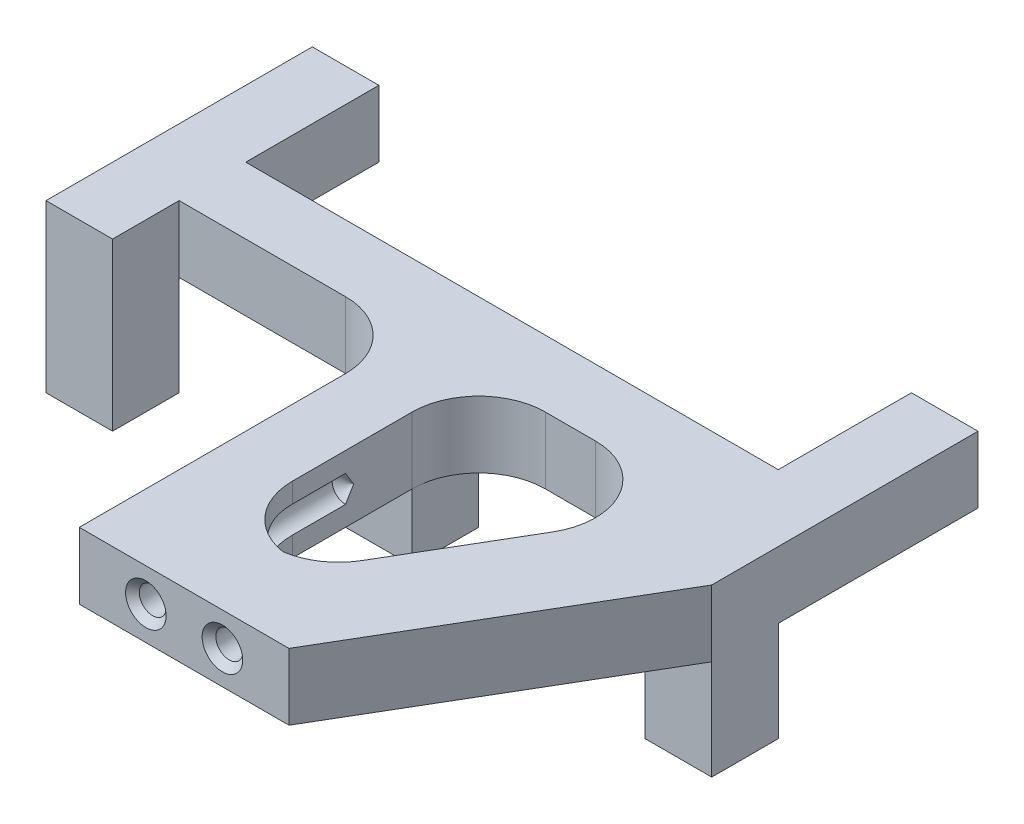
ISO-10303-21;
HEADER;
FILE_DESCRIPTION(('STEP AP214'),'2;1');
FILE_NAME('part.step','',(''),(''),'','','');
FILE_SCHEMA(('AUTOMOTIVE_DESIGN { 1 0 10303 214 1 1 1 1 }'));
ENDSEC;
DATA;
#1=APPLICATION_CONTEXT('core data for automotive mechanical design processes');
#2=APPLICATION_PROTOCOL_DEFINITION('international standard','automotive_design',2000,#1);
#3=PRODUCT_CONTEXT('',#1,'mechanical');
#4=PRODUCT('Part','Part','',(#3));
#5=PRODUCT_RELATED_PRODUCT_CATEGORY('part','',(#4));
#6=PRODUCT_DEFINITION_FORMATION('','',#4);
#7=PRODUCT_DEFINITION_CONTEXT('part definition',#1,'design');
#8=PRODUCT_DEFINITION('design','',#6,#7);
#9=PRODUCT_DEFINITION_SHAPE('','',#8);
#10=(LENGTH_UNIT() NAMED_UNIT(*) SI_UNIT(.MILLI.,.METRE.));
#11=(NAMED_UNIT(*) PLANE_ANGLE_UNIT() SI_UNIT($,.RADIAN.));
#12=(NAMED_UNIT(*) SI_UNIT($,.STERADIAN.) SOLID_ANGLE_UNIT());
#13=UNCERTAINTY_MEASURE_WITH_UNIT(LENGTH_MEASURE(1.E-05),#10,'distance_accuracy_value','');
#14=(GEOMETRIC_REPRESENTATION_CONTEXT(3) GLOBAL_UNCERTAINTY_ASSIGNED_CONTEXT((#13)) GLOBAL_UNIT_ASSIGNED_CONTEXT((#10,
#11,#12)) REPRESENTATION_CONTEXT('',''));
#15=CARTESIAN_POINT('',(0.,0.,0.));
#16=DIRECTION('',(0.,0.,1.));
#17=DIRECTION('',(1.,0.,0.));
#18=AXIS2_PLACEMENT_3D('',#15,#16,#17);
#19=CARTESIAN_POINT('',(0.,0.,50.));
#20=DIRECTION('',(-1.,0.,0.));
#21=DIRECTION('',(0.,0.,1.));
#22=AXIS2_PLACEMENT_3D('',#19,#20,#21);
#23=PLANE('',#22);
#24=DIRECTION('',(0.,0.,-1.));
#25=VECTOR('',#24,1.);
#26=CARTESIAN_POINT('',(0.,10.,50.));
#27=LINE('',#26,#25);
#28=CARTESIAN_POINT('',(0.,10.,50.));
#29=VERTEX_POINT('',#28);
#30=CARTESIAN_POINT('',(0.,10.,10.));
#31=VERTEX_POINT('',#30);
#32=EDGE_CURVE('E411',#29,#31,#27,.T.);
#33=ORIENTED_EDGE('',*,*,#32,.T.);
#34=DIRECTION('',(0.,1.,0.));
#35=VECTOR('',#34,1.);
#36=CARTESIAN_POINT('',(0.,0.,10.));
#37=LINE('',#36,#35);
#38=CARTESIAN_POINT('',(0.,0.,10.));
#39=VERTEX_POINT('',#38);
#40=EDGE_CURVE('E413',#31,#39,#37,.F.);
#41=ORIENTED_EDGE('',*,*,#40,.T.);
#42=DIRECTION('',(0.,0.,-1.));
#43=VECTOR('',#42,1.);
#44=CARTESIAN_POINT('',(0.,0.,50.));
#45=LINE('',#44,#43);
#46=CARTESIAN_POINT('',(0.,0.,50.));
#47=VERTEX_POINT('',#46);
#48=EDGE_CURVE('E420',#47,#39,#45,.T.);
#49=ORIENTED_EDGE('',*,*,#48,.F.);
#50=DIRECTION('',(0.,1.,0.));
#51=VECTOR('',#50,1.);
#52=CARTESIAN_POINT('',(0.,0.,50.));
#53=LINE('',#52,#51);
#54=EDGE_CURVE('E416',#47,#29,#53,.T.);
#55=ORIENTED_EDGE('',*,*,#54,.T.);
#56=EDGE_LOOP('',(#33,#41,#49,#55));
#57=FACE_BOUND('',#56,.T.);
#58=ADVANCED_FACE('F35',(#57),#23,.T.);
#59=CARTESIAN_POINT('',(10.,0.,50.));
#60=DIRECTION('',(-1.,0.,0.));
#61=DIRECTION('',(0.,0.,1.));
#62=AXIS2_PLACEMENT_3D('',#59,#60,#61);
#63=PLANE('',#62);
#64=DIRECTION('',(0.,-0.857167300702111,0.515038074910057));
#65=VECTOR('',#64,1.);
#66=CARTESIAN_POINT('',(10.,4.99999999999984,18.7866821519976));
#67=LINE('',#66,#65);
#68=CARTESIAN_POINT('',(10.0000000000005,4.99999999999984,18.7866821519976));
#69=VERTEX_POINT('',#68);
#70=CARTESIAN_POINT('',(10.,2.98069999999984,20.));
#71=VERTEX_POINT('',#70);
#72=EDGE_CURVE('E11',#69,#71,#67,.T.);
#73=ORIENTED_EDGE('',*,*,#72,.T.);
#74=DIRECTION('',(0.,0.,1.));
#75=VECTOR('',#74,1.);
#76=CARTESIAN_POINT('',(10.,2.98069999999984,50.));
#77=LINE('',#76,#75);
#78=CARTESIAN_POINT('',(10.,2.98069999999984,28.));
#79=VERTEX_POINT('',#78);
#80=EDGE_CURVE('E466',#71,#79,#77,.T.);
#81=ORIENTED_EDGE('',*,*,#80,.T.);
#82=DIRECTION('',(0.,-1.,0.));
#83=VECTOR('',#82,1.);
#84=CARTESIAN_POINT('',(10.,0.,28.));
#85=LINE('',#84,#83);
#86=CARTESIAN_POINT('',(10.,0.,28.));
#87=VERTEX_POINT('',#86);
#88=EDGE_CURVE('E653',#79,#87,#85,.T.);
#89=ORIENTED_EDGE('',*,*,#88,.T.);
#90=DIRECTION('',(0.,0.,-1.));
#91=VECTOR('',#90,1.);
#92=CARTESIAN_POINT('',(10.,0.,50.));
#93=LINE('',#92,#91);
#94=CARTESIAN_POINT('',(10.,0.,10.));
#95=VERTEX_POINT('',#94);
#96=EDGE_CURVE('E636',#87,#95,#93,.T.);
#97=ORIENTED_EDGE('',*,*,#96,.T.);
#98=DIRECTION('',(0.,1.,0.));
#99=VECTOR('',#98,1.);
#100=CARTESIAN_POINT('',(10.,10.,10.));
#101=LINE('',#100,#99);
#102=CARTESIAN_POINT('',(10.,10.,10.));
#103=VERTEX_POINT('',#102);
#104=EDGE_CURVE('E650',#95,#103,#101,.T.);
#105=ORIENTED_EDGE('',*,*,#104,.T.);
#106=DIRECTION('',(0.,0.,-1.));
#107=VECTOR('',#106,1.);
#108=CARTESIAN_POINT('',(10.,10.,50.));
#109=LINE('',#108,#107);
#110=CARTESIAN_POINT('',(10.,10.,28.));
#111=VERTEX_POINT('',#110);
#112=EDGE_CURVE('E419',#111,#103,#109,.T.);
#113=ORIENTED_EDGE('',*,*,#112,.F.);
#114=CARTESIAN_POINT('',(10.,7.01929999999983,28.));
#115=VERTEX_POINT('',#114);
#116=EDGE_CURVE('E654',#111,#115,#85,.T.);
#117=ORIENTED_EDGE('',*,*,#116,.T.);
#118=DIRECTION('',(0.,0.,1.));
#119=VECTOR('',#118,1.);
#120=CARTESIAN_POINT('',(10.,7.01929999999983,50.));
#121=LINE('',#120,#119);
#122=CARTESIAN_POINT('',(10.,7.01929999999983,20.));
#123=VERTEX_POINT('',#122);
#124=EDGE_CURVE('E50',#115,#123,#121,.F.);
#125=ORIENTED_EDGE('',*,*,#124,.T.);
#126=DIRECTION('',(0.,-0.857167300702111,-0.515038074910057));
#127=VECTOR('',#126,1.);
#128=CARTESIAN_POINT('',(10.,4.99999999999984,18.7866821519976));
#129=LINE('',#128,#127);
#130=EDGE_CURVE('E43',#123,#69,#129,.T.);
#131=ORIENTED_EDGE('',*,*,#130,.T.);
#132=EDGE_LOOP('',(#73,#81,#89,#97,#105,#113,#117,#125,#131));
#133=FACE_BOUND('',#132,.T.);
#134=ADVANCED_FACE('F247',(#133),#63,.F.);
#135=CARTESIAN_POINT('',(55.,-15.,10.));
#136=DIRECTION('',(0.,0.,-1.));
#137=DIRECTION('',(-1.,0.,0.));
#138=AXIS2_PLACEMENT_3D('',#135,#136,#137);
#139=PLANE('',#138);
#140=DIRECTION('',(1.,0.,0.));
#141=VECTOR('',#140,1.);
#142=CARTESIAN_POINT('',(55.,0.,10.));
#143=LINE('',#142,#141);
#144=CARTESIAN_POINT('',(45.,0.,10.));
#145=VERTEX_POINT('',#144);
#146=CARTESIAN_POINT('',(55.,0.,10.));
#147=VERTEX_POINT('',#146);
#148=EDGE_CURVE('E483',#145,#147,#143,.T.);
#149=ORIENTED_EDGE('',*,*,#148,.F.);
#150=DIRECTION('',(0.,1.,0.));
#151=VECTOR('',#150,1.);
#152=CARTESIAN_POINT('',(45.,-15.,10.));
#153=LINE('',#152,#151);
#154=CARTESIAN_POINT('',(45.,-15.,10.));
#155=VERTEX_POINT('',#154);
#156=EDGE_CURVE('E542',#155,#145,#153,.T.);
#157=ORIENTED_EDGE('',*,*,#156,.F.);
#158=DIRECTION('',(-1.,0.,0.));
#159=VECTOR('',#158,1.);
#160=CARTESIAN_POINT('',(55.,-15.,10.));
#161=LINE('',#160,#159);
#162=CARTESIAN_POINT('',(55.,-15.,10.));
#163=VERTEX_POINT('',#162);
#164=EDGE_CURVE('E535',#163,#155,#161,.T.);
#165=ORIENTED_EDGE('',*,*,#164,.F.);
#166=DIRECTION('',(0.,1.,0.));
#167=VECTOR('',#166,1.);
#168=CARTESIAN_POINT('',(55.,-15.,10.));
#169=LINE('',#168,#167);
#170=EDGE_CURVE('E538',#163,#147,#169,.T.);
#171=ORIENTED_EDGE('',*,*,#170,.T.);
#172=EDGE_LOOP('',(#149,#157,#165,#171));
#173=FACE_BOUND('',#172,.T.);
#174=ADVANCED_FACE('F313',(#173),#139,.F.);
#175=CARTESIAN_POINT('',(45.,-15.,0.));
#176=DIRECTION('',(1.,0.,0.));
#177=DIRECTION('',(0.,0.,-1.));
#178=AXIS2_PLACEMENT_3D('',#175,#176,#177);
#179=PLANE('',#178);
#180=DIRECTION('',(0.,0.,1.));
#181=VECTOR('',#180,1.);
#182=CARTESIAN_POINT('',(45.,0.,0.));
#183=LINE('',#182,#181);
#184=CARTESIAN_POINT('',(45.,0.,0.));
#185=VERTEX_POINT('',#184);
#186=EDGE_CURVE('E480',#185,#145,#183,.T.);
#187=ORIENTED_EDGE('',*,*,#186,.F.);
#188=DIRECTION('',(0.,1.,0.));
#189=VECTOR('',#188,1.);
#190=CARTESIAN_POINT('',(45.,-15.,0.));
#191=LINE('',#190,#189);
#192=CARTESIAN_POINT('',(45.,-15.,0.));
#193=VERTEX_POINT('',#192);
#194=EDGE_CURVE('E544',#193,#185,#191,.T.);
#195=ORIENTED_EDGE('',*,*,#194,.F.);
#196=DIRECTION('',(0.,0.,-1.));
#197=VECTOR('',#196,1.);
#198=CARTESIAN_POINT('',(45.,-15.,0.));
#199=LINE('',#198,#197);
#200=EDGE_CURVE('E533',#155,#193,#199,.T.);
#201=ORIENTED_EDGE('',*,*,#200,.F.);
#202=ORIENTED_EDGE('',*,*,#156,.T.);
#203=EDGE_LOOP('',(#187,#195,#201,#202));
#204=FACE_BOUND('',#203,.T.);
#205=ADVANCED_FACE('F316',(#204),#179,.F.);
#206=DIRECTION('',(0.,1.,0.));
#207=VECTOR('',#206,1.);
#208=CARTESIAN_POINT('',(10.,-10.,0.));
#209=LINE('',#208,#207);
#210=CARTESIAN_POINT('',(10.,-10.,0.));
#211=VERTEX_POINT('',#210);
#212=CARTESIAN_POINT('',(10.,0.,0.));
#213=VERTEX_POINT('',#212);
#214=EDGE_CURVE('E601',#211,#213,#209,.T.);
#215=ORIENTED_EDGE('',*,*,#214,.T.);
#216=DIRECTION('',(0.,0.,1.));
#217=VECTOR('',#216,1.);
#218=CARTESIAN_POINT('',(10.,0.,50.));
#219=LINE('',#218,#217);
#220=EDGE_CURVE('E59',#213,#95,#219,.T.);
#221=ORIENTED_EDGE('',*,*,#220,.T.);
#222=DIRECTION('',(0.,1.,0.));
#223=VECTOR('',#222,1.);
#224=CARTESIAN_POINT('',(10.,-10.,10.));
#225=LINE('',#224,#223);
#226=CARTESIAN_POINT('',(10.,-10.,10.));
#227=VERTEX_POINT('',#226);
#228=EDGE_CURVE('E598',#227,#95,#225,.T.);
#229=ORIENTED_EDGE('',*,*,#228,.F.);
#230=DIRECTION('',(0.,0.,1.));
#231=VECTOR('',#230,1.);
#232=CARTESIAN_POINT('',(10.,-10.,0.));
#233=LINE('',#232,#231);
#234=EDGE_CURVE('E587',#211,#227,#233,.T.);
#235=ORIENTED_EDGE('',*,*,#234,.F.);
#236=EDGE_LOOP('',(#215,#221,#229,#235));
#237=FACE_BOUND('',#236,.T.);
#238=ADVANCED_FACE('F320',(#237),#63,.F.);
#239=CARTESIAN_POINT('',(55.,10.,-10.));
#240=DIRECTION('',(0.,0.,1.));
#241=DIRECTION('',(0.,-1.,0.));
#242=AXIS2_PLACEMENT_3D('',#239,#240,#241);
#243=PLANE('',#242);
#244=DIRECTION('',(-1.,0.,0.));
#245=VECTOR('',#244,1.);
#246=CARTESIAN_POINT('',(55.,0.,-10.));
#247=LINE('',#246,#245);
#248=CARTESIAN_POINT('',(45.,0.,-10.));
#249=VERTEX_POINT('',#248);
#250=CARTESIAN_POINT('',(-35.,0.,-10.));
#251=VERTEX_POINT('',#250);
#252=EDGE_CURVE('E620',#249,#251,#247,.T.);
#253=ORIENTED_EDGE('',*,*,#252,.T.);
#254=DIRECTION('',(0.,1.,0.));
#255=VECTOR('',#254,1.);
#256=CARTESIAN_POINT('',(-35.,10.,-10.));
#257=LINE('',#256,#255);
#258=CARTESIAN_POINT('',(-35.,10.,-10.));
#259=VERTEX_POINT('',#258);
#260=EDGE_CURVE('E489',#251,#259,#257,.T.);
#261=ORIENTED_EDGE('',*,*,#260,.T.);
#262=DIRECTION('',(-1.,0.,0.));
#263=VECTOR('',#262,1.);
#264=CARTESIAN_POINT('',(55.,10.,-10.));
#265=LINE('',#264,#263);
#266=CARTESIAN_POINT('',(45.,10.,-10.));
#267=VERTEX_POINT('',#266);
#268=EDGE_CURVE('E617',#267,#259,#265,.T.);
#269=ORIENTED_EDGE('',*,*,#268,.F.);
#270=DIRECTION('',(0.,1.,0.));
#271=VECTOR('',#270,1.);
#272=CARTESIAN_POINT('',(45.,10.,-10.));
#273=LINE('',#272,#271);
#274=EDGE_CURVE('E509',#249,#267,#273,.T.);
#275=ORIENTED_EDGE('',*,*,#274,.F.);
#276=EDGE_LOOP('',(#253,#261,#269,#275));
#277=FACE_BOUND('',#276,.T.);
#278=ADVANCED_FACE('F362',(#277),#243,.F.);
#279=CARTESIAN_POINT('',(55.,10.,0.));
#280=DIRECTION('',(0.,0.,-1.));
#281=DIRECTION('',(-1.,0.,0.));
#282=AXIS2_PLACEMENT_3D('',#279,#280,#281);
#283=PLANE('',#282);
#284=DIRECTION('',(-1.,0.,0.));
#285=VECTOR('',#284,1.);
#286=CARTESIAN_POINT('',(55.,0.,0.));
#287=LINE('',#286,#285);
#288=CARTESIAN_POINT('',(27.5269128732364,0.,0.));
#289=VERTEX_POINT('',#288);
#290=CARTESIAN_POINT('',(20.,0.,0.));
#291=VERTEX_POINT('',#290);
#292=EDGE_CURVE('E627',#289,#291,#287,.T.);
#293=ORIENTED_EDGE('',*,*,#292,.F.);
#294=DIRECTION('',(0.,1.,0.));
#295=VECTOR('',#294,1.);
#296=CARTESIAN_POINT('',(27.5269128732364,10.,0.));
#297=LINE('',#296,#295);
#298=CARTESIAN_POINT('',(27.5269128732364,10.,0.));
#299=VERTEX_POINT('',#298);
#300=EDGE_CURVE('E641',#289,#299,#297,.T.);
#301=ORIENTED_EDGE('',*,*,#300,.T.);
#302=DIRECTION('',(-1.,0.,0.));
#303=VECTOR('',#302,1.);
#304=CARTESIAN_POINT('',(55.,10.,0.));
#305=LINE('',#304,#303);
#306=CARTESIAN_POINT('',(20.,10.,0.));
#307=VERTEX_POINT('',#306);
#308=EDGE_CURVE('E616',#299,#307,#305,.T.);
#309=ORIENTED_EDGE('',*,*,#308,.T.);
#310=DIRECTION('',(0.,1.,0.));
#311=VECTOR('',#310,1.);
#312=CARTESIAN_POINT('',(20.,0.,0.));
#313=LINE('',#312,#311);
#314=EDGE_CURVE('E639',#307,#291,#313,.F.);
#315=ORIENTED_EDGE('',*,*,#314,.T.);
#316=EDGE_LOOP('',(#293,#301,#309,#315));
#317=FACE_BOUND('',#316,.T.);
#318=ADVANCED_FACE('F365',(#317),#283,.F.);
#319=CARTESIAN_POINT('',(0.,0.,50.));
#320=DIRECTION('',(0.,1.,0.));
#321=DIRECTION('',(0.,0.,1.));
#322=AXIS2_PLACEMENT_3D('',#319,#320,#321);
#323=PLANE('',#322);
#324=ORIENTED_EDGE('',*,*,#96,.F.);
#325=CARTESIAN_POINT('',(20.,0.,28.));
#326=DIRECTION('',(0.,1.,0.));
#327=DIRECTION('',(0.,0.,1.));
#328=AXIS2_PLACEMENT_3D('',#325,#326,#327);
#329=CIRCLE('',#328,10.);
#330=CARTESIAN_POINT('',(18.4759564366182,0.,37.8831822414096));
#331=VERTEX_POINT('',#330);
#332=EDGE_CURVE('E442',#87,#331,#329,.T.);
#333=ORIENTED_EDGE('',*,*,#332,.T.);
#334=CARTESIAN_POINT('',(16.9519128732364,0.,28.));
#335=DIRECTION('',(0.,1.,0.));
#336=DIRECTION('',(0.,0.,1.));
#337=AXIS2_PLACEMENT_3D('',#334,#335,#336);
#338=CIRCLE('',#337,10.);
#339=CARTESIAN_POINT('',(25.5740243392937,0.,33.0654904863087));
#340=VERTEX_POINT('',#339);
#341=EDGE_CURVE('E440',#331,#340,#338,.T.);
#342=ORIENTED_EDGE('',*,*,#341,.T.);
#343=DIRECTION('',(0.506549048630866,0.,-0.862211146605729));
#344=VECTOR('',#343,1.);
#345=CARTESIAN_POINT('',(22.675,0.,38.));
#346=LINE('',#345,#344);
#347=CARTESIAN_POINT('',(36.1490243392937,0.,15.0654904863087));
#348=VERTEX_POINT('',#347);
#349=EDGE_CURVE('E470',#340,#348,#346,.T.);
#350=ORIENTED_EDGE('',*,*,#349,.T.);
#351=CARTESIAN_POINT('',(27.5269128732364,0.,10.));
#352=DIRECTION('',(0.,1.,0.));
#353=DIRECTION('',(0.,0.,1.));
#354=AXIS2_PLACEMENT_3D('',#351,#352,#353);
#355=CIRCLE('',#354,10.);
#356=EDGE_CURVE('E430',#348,#289,#355,.T.);
#357=ORIENTED_EDGE('',*,*,#356,.T.);
#358=ORIENTED_EDGE('',*,*,#292,.T.);
#359=CARTESIAN_POINT('',(20.,0.,10.));
#360=DIRECTION('',(0.,1.,0.));
#361=DIRECTION('',(0.,0.,1.));
#362=AXIS2_PLACEMENT_3D('',#359,#360,#361);
#363=CIRCLE('',#362,10.);
#364=EDGE_CURVE('E448',#291,#95,#363,.T.);
#365=ORIENTED_EDGE('',*,*,#364,.T.);
#366=ORIENTED_EDGE('',*,*,#220,.F.);
#367=DIRECTION('',(1.,0.,0.));
#368=VECTOR('',#367,1.);
#369=CARTESIAN_POINT('',(0.,0.,0.));
#370=LINE('',#369,#368);
#371=CARTESIAN_POINT('',(0.,0.,0.));
#372=VERTEX_POINT('',#371);
#373=EDGE_CURVE('E580',#372,#213,#370,.T.);
#374=ORIENTED_EDGE('',*,*,#373,.F.);
#375=DIRECTION('',(0.,0.,-1.));
#376=VECTOR('',#375,1.);
#377=CARTESIAN_POINT('',(0.,0.,50.));
#378=LINE('',#377,#376);
#379=EDGE_CURVE('E428',#39,#372,#378,.T.);
#380=ORIENTED_EDGE('',*,*,#379,.F.);
#381=CARTESIAN_POINT('',(-10.,0.,10.));
#382=DIRECTION('',(0.,1.,0.));
#383=DIRECTION('',(0.,0.,1.));
#384=AXIS2_PLACEMENT_3D('',#381,#382,#383);
#385=CIRCLE('',#384,10.);
#386=CARTESIAN_POINT('',(-10.,0.,0.));
#387=VERTEX_POINT('',#386);
#388=EDGE_CURVE('E250',#39,#387,#385,.T.);
#389=ORIENTED_EDGE('',*,*,#388,.T.);
#390=CARTESIAN_POINT('',(-35.,0.,0.));
#391=VERTEX_POINT('',#390);
#392=EDGE_CURVE('E622',#387,#391,#287,.T.);
#393=ORIENTED_EDGE('',*,*,#392,.T.);
#394=DIRECTION('',(-1.,0.,0.));
#395=VECTOR('',#394,1.);
#396=CARTESIAN_POINT('',(0.,0.,0.));
#397=LINE('',#396,#395);
#398=CARTESIAN_POINT('',(-45.,0.,0.));
#399=VERTEX_POINT('',#398);
#400=EDGE_CURVE('E569',#391,#399,#397,.T.);
#401=ORIENTED_EDGE('',*,*,#400,.T.);
#402=DIRECTION('',(0.,0.,-1.));
#403=VECTOR('',#402,1.);
#404=CARTESIAN_POINT('',(-45.,0.,0.));
#405=LINE('',#404,#403);
#406=CARTESIAN_POINT('',(-45.,0.,-30.));
#407=VERTEX_POINT('',#406);
#408=EDGE_CURVE('E606',#399,#407,#405,.T.);
#409=ORIENTED_EDGE('',*,*,#408,.T.);
#410=DIRECTION('',(1.,0.,0.));
#411=VECTOR('',#410,1.);
#412=CARTESIAN_POINT('',(-45.,0.,-30.));
#413=LINE('',#412,#411);
#414=CARTESIAN_POINT('',(-35.,0.,-30.));
#415=VERTEX_POINT('',#414);
#416=EDGE_CURVE('E499',#407,#415,#413,.T.);
#417=ORIENTED_EDGE('',*,*,#416,.T.);
#418=DIRECTION('',(0.,0.,1.));
#419=VECTOR('',#418,1.);
#420=CARTESIAN_POINT('',(-35.,0.,-30.));
#421=LINE('',#420,#419);
#422=EDGE_CURVE('E502',#415,#251,#421,.T.);
#423=ORIENTED_EDGE('',*,*,#422,.T.);
#424=ORIENTED_EDGE('',*,*,#252,.F.);
#425=DIRECTION('',(0.,0.,1.));
#426=VECTOR('',#425,1.);
#427=CARTESIAN_POINT('',(45.,0.,-30.));
#428=LINE('',#427,#426);
#429=CARTESIAN_POINT('',(45.,0.,-30.));
#430=VERTEX_POINT('',#429);
#431=EDGE_CURVE('E525',#430,#249,#428,.T.);
#432=ORIENTED_EDGE('',*,*,#431,.F.);
#433=DIRECTION('',(-1.,0.,0.));
#434=VECTOR('',#433,1.);
#435=CARTESIAN_POINT('',(55.,0.,-30.));
#436=LINE('',#435,#434);
#437=CARTESIAN_POINT('',(55.,0.,-30.));
#438=VERTEX_POINT('',#437);
#439=EDGE_CURVE('E513',#438,#430,#436,.T.);
#440=ORIENTED_EDGE('',*,*,#439,.F.);
#441=DIRECTION('',(0.,0.,-1.));
#442=VECTOR('',#441,1.);
#443=CARTESIAN_POINT('',(55.,0.,0.));
#444=LINE('',#443,#442);
#445=CARTESIAN_POINT('',(55.,0.,0.));
#446=VERTEX_POINT('',#445);
#447=EDGE_CURVE('E607',#446,#438,#444,.T.);
#448=ORIENTED_EDGE('',*,*,#447,.F.);
#449=EDGE_CURVE('E623',#446,#185,#287,.T.);
#450=ORIENTED_EDGE('',*,*,#449,.T.);
#451=ORIENTED_EDGE('',*,*,#186,.T.);
#452=ORIENTED_EDGE('',*,*,#148,.T.);
#453=DIRECTION('',(-0.506549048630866,0.,0.862211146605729));
#454=VECTOR('',#453,1.);
#455=CARTESIAN_POINT('',(31.5,0.,50.));
#456=LINE('',#455,#454);
#457=CARTESIAN_POINT('',(31.5,0.,50.));
#458=VERTEX_POINT('',#457);
#459=EDGE_CURVE('E472',#147,#458,#456,.T.);
#460=ORIENTED_EDGE('',*,*,#459,.T.);
#461=DIRECTION('',(1.,0.,0.));
#462=VECTOR('',#461,1.);
#463=CARTESIAN_POINT('',(0.,0.,50.));
#464=LINE('',#463,#462);
#465=EDGE_CURVE('E626',#47,#458,#464,.T.);
#466=ORIENTED_EDGE('',*,*,#465,.F.);
#467=ORIENTED_EDGE('',*,*,#48,.T.);
#468=DIRECTION('',(-1.,0.,0.));
#469=VECTOR('',#468,1.);
#470=CARTESIAN_POINT('',(0.,0.,10.));
#471=LINE('',#470,#469);
#472=EDGE_CURVE('E585',#95,#39,#471,.T.);
#473=ORIENTED_EDGE('',*,*,#472,.F.);
#474=EDGE_LOOP('',(#324,#333,#342,#350,#357,#358,#365,#366,#374,#380,#389,#393,#401,#409,#417,
#423,#424,#432,#440,#448,#450,#451,#452,#460,#466,#467,#473));
#475=FACE_BOUND('',#474,.T.);
#476=ADVANCED_FACE('F369',(#475),#323,.F.);
#477=CARTESIAN_POINT('',(0.,10.,50.));
#478=DIRECTION('',(0.,1.,0.));
#479=DIRECTION('',(0.,0.,1.));
#480=AXIS2_PLACEMENT_3D('',#477,#478,#479);
#481=PLANE('',#480);
#482=DIRECTION('',(1.,0.,0.));
#483=VECTOR('',#482,1.);
#484=CARTESIAN_POINT('',(0.,10.,50.));
#485=LINE('',#484,#483);
#486=CARTESIAN_POINT('',(31.5,10.,50.));
#487=VERTEX_POINT('',#486);
#488=EDGE_CURVE('E630',#29,#487,#485,.T.);
#489=ORIENTED_EDGE('',*,*,#488,.T.);
#490=DIRECTION('',(0.506549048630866,0.,-0.862211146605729));
#491=VECTOR('',#490,1.);
#492=CARTESIAN_POINT('',(31.5,10.,50.));
#493=LINE('',#492,#491);
#494=CARTESIAN_POINT('',(55.,10.,10.));
#495=VERTEX_POINT('',#494);
#496=EDGE_CURVE('E453',#487,#495,#493,.T.);
#497=ORIENTED_EDGE('',*,*,#496,.T.);
#498=DIRECTION('',(0.,0.,1.));
#499=VECTOR('',#498,1.);
#500=CARTESIAN_POINT('',(55.,10.,0.));
#501=LINE('',#500,#499);
#502=CARTESIAN_POINT('',(55.,10.,-30.));
#503=VERTEX_POINT('',#502);
#504=EDGE_CURVE('E609',#503,#495,#501,.T.);
#505=ORIENTED_EDGE('',*,*,#504,.F.);
#506=DIRECTION('',(1.,0.,0.));
#507=VECTOR('',#506,1.);
#508=CARTESIAN_POINT('',(55.,10.,-30.));
#509=LINE('',#508,#507);
#510=CARTESIAN_POINT('',(45.,10.,-30.));
#511=VERTEX_POINT('',#510);
#512=EDGE_CURVE('E517',#511,#503,#509,.T.);
#513=ORIENTED_EDGE('',*,*,#512,.F.);
#514=DIRECTION('',(0.,0.,1.));
#515=VECTOR('',#514,1.);
#516=CARTESIAN_POINT('',(45.,10.,-30.));
#517=LINE('',#516,#515);
#518=EDGE_CURVE('E520',#511,#267,#517,.T.);
#519=ORIENTED_EDGE('',*,*,#518,.T.);
#520=ORIENTED_EDGE('',*,*,#268,.T.);
#521=DIRECTION('',(0.,0.,1.));
#522=VECTOR('',#521,1.);
#523=CARTESIAN_POINT('',(-35.,10.,-30.));
#524=LINE('',#523,#522);
#525=CARTESIAN_POINT('',(-35.,10.,-30.));
#526=VERTEX_POINT('',#525);
#527=EDGE_CURVE('E506',#526,#259,#524,.T.);
#528=ORIENTED_EDGE('',*,*,#527,.F.);
#529=DIRECTION('',(-1.,0.,0.));
#530=VECTOR('',#529,1.);
#531=CARTESIAN_POINT('',(-45.,10.,-30.));
#532=LINE('',#531,#530);
#533=CARTESIAN_POINT('',(-45.,10.,-30.));
#534=VERTEX_POINT('',#533);
#535=EDGE_CURVE('E493',#526,#534,#532,.T.);
#536=ORIENTED_EDGE('',*,*,#535,.T.);
#537=DIRECTION('',(0.,0.,1.));
#538=VECTOR('',#537,1.);
#539=CARTESIAN_POINT('',(-45.,10.,0.));
#540=LINE('',#539,#538);
#541=CARTESIAN_POINT('',(-45.,10.,10.));
#542=VERTEX_POINT('',#541);
#543=EDGE_CURVE('E610',#534,#542,#540,.T.);
#544=ORIENTED_EDGE('',*,*,#543,.T.);
#545=DIRECTION('',(1.,0.,0.));
#546=VECTOR('',#545,1.);
#547=CARTESIAN_POINT('',(-45.,10.,10.));
#548=LINE('',#547,#546);
#549=CARTESIAN_POINT('',(-35.,10.,10.));
#550=VERTEX_POINT('',#549);
#551=EDGE_CURVE('E541',#542,#550,#548,.T.);
#552=ORIENTED_EDGE('',*,*,#551,.T.);
#553=DIRECTION('',(0.,0.,-1.));
#554=VECTOR('',#553,1.);
#555=CARTESIAN_POINT('',(-35.,10.,0.));
#556=LINE('',#555,#554);
#557=CARTESIAN_POINT('',(-35.,10.,0.));
#558=VERTEX_POINT('',#557);
#559=EDGE_CURVE('E552',#550,#558,#556,.T.);
#560=ORIENTED_EDGE('',*,*,#559,.T.);
#561=CARTESIAN_POINT('',(-10.,10.,0.));
#562=VERTEX_POINT('',#561);
#563=EDGE_CURVE('E612',#562,#558,#305,.T.);
#564=ORIENTED_EDGE('',*,*,#563,.F.);
#565=CARTESIAN_POINT('',(-10.,10.,10.));
#566=DIRECTION('',(0.,1.,0.));
#567=DIRECTION('',(0.,0.,1.));
#568=AXIS2_PLACEMENT_3D('',#565,#566,#567);
#569=CIRCLE('',#568,10.);
#570=EDGE_CURVE('E425',#562,#31,#569,.F.);
#571=ORIENTED_EDGE('',*,*,#570,.T.);
#572=ORIENTED_EDGE('',*,*,#32,.F.);
#573=EDGE_LOOP('',(#489,#497,#505,#513,#519,#520,#528,#536,#544,#552,#560,#564,#571,#572));
#574=FACE_BOUND('',#573,.T.);
#575=ORIENTED_EDGE('',*,*,#308,.F.);
#576=CARTESIAN_POINT('',(27.5269128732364,10.,10.));
#577=DIRECTION('',(0.,1.,0.));
#578=DIRECTION('',(0.,0.,1.));
#579=AXIS2_PLACEMENT_3D('',#576,#577,#578);
#580=CIRCLE('',#579,10.);
#581=CARTESIAN_POINT('',(36.1490243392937,10.,15.0654904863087));
#582=VERTEX_POINT('',#581);
#583=EDGE_CURVE('E427',#299,#582,#580,.F.);
#584=ORIENTED_EDGE('',*,*,#583,.T.);
#585=DIRECTION('',(-0.506549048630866,0.,0.862211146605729));
#586=VECTOR('',#585,1.);
#587=CARTESIAN_POINT('',(22.675,10.,38.));
#588=LINE('',#587,#586);
#589=CARTESIAN_POINT('',(25.5740243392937,10.,33.0654904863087));
#590=VERTEX_POINT('',#589);
#591=EDGE_CURVE('E457',#582,#590,#588,.T.);
#592=ORIENTED_EDGE('',*,*,#591,.T.);
#593=CARTESIAN_POINT('',(16.9519128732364,10.,28.));
#594=DIRECTION('',(0.,1.,0.));
#595=DIRECTION('',(0.,0.,1.));
#596=AXIS2_PLACEMENT_3D('',#593,#594,#595);
#597=CIRCLE('',#596,10.);
#598=CARTESIAN_POINT('',(18.4759564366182,10.,37.8831822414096));
#599=VERTEX_POINT('',#598);
#600=EDGE_CURVE('E438',#590,#599,#597,.F.);
#601=ORIENTED_EDGE('',*,*,#600,.T.);
#602=CARTESIAN_POINT('',(20.,10.,28.));
#603=DIRECTION('',(0.,1.,0.));
#604=DIRECTION('',(0.,0.,1.));
#605=AXIS2_PLACEMENT_3D('',#602,#603,#604);
#606=CIRCLE('',#605,10.);
#607=EDGE_CURVE('E444',#599,#111,#606,.F.);
#608=ORIENTED_EDGE('',*,*,#607,.T.);
#609=ORIENTED_EDGE('',*,*,#112,.T.);
#610=CARTESIAN_POINT('',(20.,10.,10.));
#611=DIRECTION('',(0.,1.,0.));
#612=DIRECTION('',(0.,0.,1.));
#613=AXIS2_PLACEMENT_3D('',#610,#611,#612);
#614=CIRCLE('',#613,10.);
#615=EDGE_CURVE('E446',#103,#307,#614,.F.);
#616=ORIENTED_EDGE('',*,*,#615,.T.);
#617=EDGE_LOOP('',(#575,#584,#592,#601,#608,#609,#616));
#618=FACE_BOUND('',#617,.T.);
#619=ADVANCED_FACE('F378',(#574,#618),#481,.T.);
#620=DIRECTION('',(0.,1.,0.));
#621=VECTOR('',#620,1.);
#622=CARTESIAN_POINT('',(0.,-10.,10.));
#623=LINE('',#622,#621);
#624=CARTESIAN_POINT('',(0.,-10.,10.));
#625=VERTEX_POINT('',#624);
#626=EDGE_CURVE('E591',#625,#39,#623,.T.);
#627=ORIENTED_EDGE('',*,*,#626,.T.);
#628=ORIENTED_EDGE('',*,*,#379,.T.);
#629=DIRECTION('',(0.,1.,0.));
#630=VECTOR('',#629,1.);
#631=CARTESIAN_POINT('',(0.,-10.,0.));
#632=LINE('',#631,#630);
#633=CARTESIAN_POINT('',(0.,-10.,0.));
#634=VERTEX_POINT('',#633);
#635=EDGE_CURVE('E603',#634,#372,#632,.T.);
#636=ORIENTED_EDGE('',*,*,#635,.F.);
#637=DIRECTION('',(0.,0.,-1.));
#638=VECTOR('',#637,1.);
#639=CARTESIAN_POINT('',(0.,-10.,0.));
#640=LINE('',#639,#638);
#641=EDGE_CURVE('E581',#625,#634,#640,.T.);
#642=ORIENTED_EDGE('',*,*,#641,.F.);
#643=EDGE_LOOP('',(#627,#628,#636,#642));
#644=FACE_BOUND('',#643,.T.);
#645=ADVANCED_FACE('F374',(#644),#23,.T.);
#646=CARTESIAN_POINT('',(0.,0.,50.));
#647=DIRECTION('',(0.,0.,1.));
#648=DIRECTION('',(1.,0.,0.));
#649=AXIS2_PLACEMENT_3D('',#646,#647,#648);
#650=PLANE('',#649);
#651=CARTESIAN_POINT('',(10.0000000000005,4.99999999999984,50.));
#652=DIRECTION('',(0.,0.,1.));
#653=DIRECTION('',(1.,0.,0.));
#654=AXIS2_PLACEMENT_3D('',#651,#652,#653);
#655=CIRCLE('',#654,3.048);
#656=CARTESIAN_POINT('',(13.0480000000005,4.99999999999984,50.));
#657=VERTEX_POINT('',#656);
#658=EDGE_CURVE('E686',#657,#657,#655,.T.);
#659=ORIENTED_EDGE('',*,*,#658,.F.);
#660=EDGE_LOOP('',(#659));
#661=FACE_BOUND('',#660,.T.);
#662=CARTESIAN_POINT('',(21.5000000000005,4.99999999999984,50.));
#663=DIRECTION('',(0.,0.,1.));
#664=DIRECTION('',(1.,0.,0.));
#665=AXIS2_PLACEMENT_3D('',#662,#663,#664);
#666=CIRCLE('',#665,3.048);
#667=CARTESIAN_POINT('',(24.5480000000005,4.99999999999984,50.));
#668=VERTEX_POINT('',#667);
#669=EDGE_CURVE('E462',#668,#668,#666,.T.);
#670=ORIENTED_EDGE('',*,*,#669,.F.);
#671=EDGE_LOOP('',(#670));
#672=FACE_BOUND('',#671,.T.);
#673=ORIENTED_EDGE('',*,*,#465,.T.);
#674=DIRECTION('',(0.,1.,0.));
#675=VECTOR('',#674,1.);
#676=CARTESIAN_POINT('',(31.5,10.,50.));
#677=LINE('',#676,#675);
#678=EDGE_CURVE('E486',#458,#487,#677,.T.);
#679=ORIENTED_EDGE('',*,*,#678,.T.);
#680=ORIENTED_EDGE('',*,*,#488,.F.);
#681=ORIENTED_EDGE('',*,*,#54,.F.);
#682=EDGE_LOOP('',(#673,#679,#680,#681));
#683=FACE_BOUND('',#682,.T.);
#684=ADVANCED_FACE('F371',(#661,#672,#683),#650,.T.);
#685=ORIENTED_EDGE('',*,*,#392,.F.);
#686=DIRECTION('',(0.,1.,0.));
#687=VECTOR('',#686,1.);
#688=CARTESIAN_POINT('',(-10.,10.,0.));
#689=LINE('',#688,#687);
#690=EDGE_CURVE('E432',#387,#562,#689,.T.);
#691=ORIENTED_EDGE('',*,*,#690,.T.);
#692=ORIENTED_EDGE('',*,*,#563,.T.);
#693=DIRECTION('',(0.,1.,0.));
#694=VECTOR('',#693,1.);
#695=CARTESIAN_POINT('',(-35.,-15.,0.));
#696=LINE('',#695,#694);
#697=EDGE_CURVE('E573',#391,#558,#696,.T.);
#698=ORIENTED_EDGE('',*,*,#697,.F.);
#699=EDGE_LOOP('',(#685,#691,#692,#698));
#700=FACE_BOUND('',#699,.T.);
#701=ADVANCED_FACE('F357',(#700),#283,.F.);
#702=CARTESIAN_POINT('',(55.,0.,0.));
#703=DIRECTION('',(1.,0.,0.));
#704=DIRECTION('',(0.,0.,-1.));
#705=AXIS2_PLACEMENT_3D('',#702,#703,#704);
#706=PLANE('',#705);
#707=ORIENTED_EDGE('',*,*,#504,.T.);
#708=DIRECTION('',(0.,1.,0.));
#709=VECTOR('',#708,1.);
#710=CARTESIAN_POINT('',(55.,-59.5391100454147,10.));
#711=LINE('',#710,#709);
#712=EDGE_CURVE('E473',#147,#495,#711,.T.);
#713=ORIENTED_EDGE('',*,*,#712,.F.);
#714=ORIENTED_EDGE('',*,*,#170,.F.);
#715=DIRECTION('',(0.,0.,1.));
#716=VECTOR('',#715,1.);
#717=CARTESIAN_POINT('',(55.,-15.,0.));
#718=LINE('',#717,#716);
#719=CARTESIAN_POINT('',(55.,-15.,0.));
#720=VERTEX_POINT('',#719);
#721=EDGE_CURVE('E528',#720,#163,#718,.T.);
#722=ORIENTED_EDGE('',*,*,#721,.F.);
#723=DIRECTION('',(0.,1.,0.));
#724=VECTOR('',#723,1.);
#725=CARTESIAN_POINT('',(55.,-15.,0.));
#726=LINE('',#725,#724);
#727=EDGE_CURVE('E537',#720,#446,#726,.T.);
#728=ORIENTED_EDGE('',*,*,#727,.T.);
#729=ORIENTED_EDGE('',*,*,#447,.T.);
#730=DIRECTION('',(0.,-1.,0.));
#731=VECTOR('',#730,1.);
#732=CARTESIAN_POINT('',(55.,10.,-30.));
#733=LINE('',#732,#731);
#734=EDGE_CURVE('E510',#503,#438,#733,.T.);
#735=ORIENTED_EDGE('',*,*,#734,.F.);
#736=EDGE_LOOP('',(#707,#713,#714,#722,#728,#729,#735));
#737=FACE_BOUND('',#736,.T.);
#738=ADVANCED_FACE('F354',(#737),#706,.T.);
#739=CARTESIAN_POINT('',(-45.,0.,0.));
#740=DIRECTION('',(1.,0.,0.));
#741=DIRECTION('',(0.,0.,-1.));
#742=AXIS2_PLACEMENT_3D('',#739,#740,#741);
#743=PLANE('',#742);
#744=ORIENTED_EDGE('',*,*,#408,.F.);
#745=DIRECTION('',(0.,1.,0.));
#746=VECTOR('',#745,1.);
#747=CARTESIAN_POINT('',(-45.,-15.,0.));
#748=LINE('',#747,#746);
#749=CARTESIAN_POINT('',(-45.,-15.,0.));
#750=VERTEX_POINT('',#749);
#751=EDGE_CURVE('E566',#750,#399,#748,.T.);
#752=ORIENTED_EDGE('',*,*,#751,.F.);
#753=DIRECTION('',(0.,0.,1.));
#754=VECTOR('',#753,1.);
#755=CARTESIAN_POINT('',(-45.,-15.,0.));
#756=LINE('',#755,#754);
#757=CARTESIAN_POINT('',(-45.,-15.,10.));
#758=VERTEX_POINT('',#757);
#759=EDGE_CURVE('E548',#750,#758,#756,.T.);
#760=ORIENTED_EDGE('',*,*,#759,.T.);
#761=DIRECTION('',(0.,1.,0.));
#762=VECTOR('',#761,1.);
#763=CARTESIAN_POINT('',(-45.,-15.,10.));
#764=LINE('',#763,#762);
#765=EDGE_CURVE('E561',#758,#542,#764,.T.);
#766=ORIENTED_EDGE('',*,*,#765,.T.);
#767=ORIENTED_EDGE('',*,*,#543,.F.);
#768=DIRECTION('',(0.,-1.,0.));
#769=VECTOR('',#768,1.);
#770=CARTESIAN_POINT('',(-45.,10.,-30.));
#771=LINE('',#770,#769);
#772=EDGE_CURVE('E490',#534,#407,#771,.T.);
#773=ORIENTED_EDGE('',*,*,#772,.T.);
#774=EDGE_LOOP('',(#744,#752,#760,#766,#767,#773));
#775=FACE_BOUND('',#774,.T.);
#776=ADVANCED_FACE('F352',(#775),#743,.F.);
#777=CARTESIAN_POINT('',(0.,-10.,0.));
#778=DIRECTION('',(0.,0.,1.));
#779=DIRECTION('',(1.,0.,0.));
#780=AXIS2_PLACEMENT_3D('',#777,#778,#779);
#781=PLANE('',#780);
#782=ORIENTED_EDGE('',*,*,#373,.T.);
#783=ORIENTED_EDGE('',*,*,#214,.F.);
#784=DIRECTION('',(1.,0.,0.));
#785=VECTOR('',#784,1.);
#786=CARTESIAN_POINT('',(0.,-10.,0.));
#787=LINE('',#786,#785);
#788=EDGE_CURVE('E584',#634,#211,#787,.T.);
#789=ORIENTED_EDGE('',*,*,#788,.F.);
#790=ORIENTED_EDGE('',*,*,#635,.T.);
#791=EDGE_LOOP('',(#782,#783,#789,#790));
#792=FACE_BOUND('',#791,.T.);
#793=ADVANCED_FACE('F348',(#792),#781,.F.);
#794=CARTESIAN_POINT('',(0.,-10.,10.));
#795=DIRECTION('',(0.,0.,-1.));
#796=DIRECTION('',(-1.,0.,0.));
#797=AXIS2_PLACEMENT_3D('',#794,#795,#796);
#798=PLANE('',#797);
#799=ORIENTED_EDGE('',*,*,#472,.T.);
#800=ORIENTED_EDGE('',*,*,#626,.F.);
#801=DIRECTION('',(-1.,0.,0.));
#802=VECTOR('',#801,1.);
#803=CARTESIAN_POINT('',(0.,-10.,10.));
#804=LINE('',#803,#802);
#805=EDGE_CURVE('E589',#227,#625,#804,.T.);
#806=ORIENTED_EDGE('',*,*,#805,.F.);
#807=ORIENTED_EDGE('',*,*,#228,.T.);
#808=EDGE_LOOP('',(#799,#800,#806,#807));
#809=FACE_BOUND('',#808,.T.);
#810=ADVANCED_FACE('F344',(#809),#798,.F.);
#811=CARTESIAN_POINT('',(0.,-10.,0.));
#812=DIRECTION('',(0.,1.,0.));
#813=DIRECTION('',(0.,0.,1.));
#814=AXIS2_PLACEMENT_3D('',#811,#812,#813);
#815=PLANE('',#814);
#816=ORIENTED_EDGE('',*,*,#641,.T.);
#817=ORIENTED_EDGE('',*,*,#788,.T.);
#818=ORIENTED_EDGE('',*,*,#234,.T.);
#819=ORIENTED_EDGE('',*,*,#805,.T.);
#820=EDGE_LOOP('',(#816,#817,#818,#819));
#821=FACE_BOUND('',#820,.T.);
#822=ADVANCED_FACE('F334',(#821),#815,.F.);
#823=CARTESIAN_POINT('',(-45.,-15.,0.));
#824=DIRECTION('',(0.,0.,-1.));
#825=DIRECTION('',(-1.,0.,0.));
#826=AXIS2_PLACEMENT_3D('',#823,#824,#825);
#827=PLANE('',#826);
#828=ORIENTED_EDGE('',*,*,#400,.F.);
#829=CARTESIAN_POINT('',(-35.,-15.,0.));
#830=VERTEX_POINT('',#829);
#831=EDGE_CURVE('E570',#830,#391,#696,.T.);
#832=ORIENTED_EDGE('',*,*,#831,.F.);
#833=DIRECTION('',(-1.,0.,0.));
#834=VECTOR('',#833,1.);
#835=CARTESIAN_POINT('',(-45.,-15.,0.));
#836=LINE('',#835,#834);
#837=EDGE_CURVE('E558',#830,#750,#836,.T.);
#838=ORIENTED_EDGE('',*,*,#837,.T.);
#839=ORIENTED_EDGE('',*,*,#751,.T.);
#840=EDGE_LOOP('',(#828,#832,#838,#839));
#841=FACE_BOUND('',#840,.T.);
#842=ADVANCED_FACE('F330',(#841),#827,.T.);
#843=CARTESIAN_POINT('',(-35.,-15.,0.));
#844=DIRECTION('',(1.,0.,0.));
#845=DIRECTION('',(0.,0.,-1.));
#846=AXIS2_PLACEMENT_3D('',#843,#844,#845);
#847=PLANE('',#846);
#848=ORIENTED_EDGE('',*,*,#559,.F.);
#849=DIRECTION('',(0.,1.,0.));
#850=VECTOR('',#849,1.);
#851=CARTESIAN_POINT('',(-35.,-15.,10.));
#852=LINE('',#851,#850);
#853=CARTESIAN_POINT('',(-35.,-15.,10.));
#854=VERTEX_POINT('',#853);
#855=EDGE_CURVE('E574',#854,#550,#852,.T.);
#856=ORIENTED_EDGE('',*,*,#855,.F.);
#857=DIRECTION('',(0.,0.,-1.));
#858=VECTOR('',#857,1.);
#859=CARTESIAN_POINT('',(-35.,-15.,0.));
#860=LINE('',#859,#858);
#861=EDGE_CURVE('E555',#854,#830,#860,.T.);
#862=ORIENTED_EDGE('',*,*,#861,.T.);
#863=ORIENTED_EDGE('',*,*,#831,.T.);
#864=ORIENTED_EDGE('',*,*,#697,.T.);
#865=EDGE_LOOP('',(#848,#856,#862,#863,#864));
#866=FACE_BOUND('',#865,.T.);
#867=ADVANCED_FACE('F333',(#866),#847,.T.);
#868=CARTESIAN_POINT('',(-45.,-15.,10.));
#869=DIRECTION('',(0.,0.,1.));
#870=DIRECTION('',(1.,0.,0.));
#871=AXIS2_PLACEMENT_3D('',#868,#869,#870);
#872=PLANE('',#871);
#873=ORIENTED_EDGE('',*,*,#551,.F.);
#874=ORIENTED_EDGE('',*,*,#765,.F.);
#875=DIRECTION('',(1.,0.,0.));
#876=VECTOR('',#875,1.);
#877=CARTESIAN_POINT('',(-45.,-15.,10.));
#878=LINE('',#877,#876);
#879=EDGE_CURVE('E551',#758,#854,#878,.T.);
#880=ORIENTED_EDGE('',*,*,#879,.T.);
#881=ORIENTED_EDGE('',*,*,#855,.T.);
#882=EDGE_LOOP('',(#873,#874,#880,#881));
#883=FACE_BOUND('',#882,.T.);
#884=ADVANCED_FACE('F328',(#883),#872,.T.);
#885=CARTESIAN_POINT('',(0.,-15.,0.));
#886=DIRECTION('',(0.,1.,0.));
#887=DIRECTION('',(0.,0.,1.));
#888=AXIS2_PLACEMENT_3D('',#885,#886,#887);
#889=PLANE('',#888);
#890=ORIENTED_EDGE('',*,*,#759,.F.);
#891=ORIENTED_EDGE('',*,*,#837,.F.);
#892=ORIENTED_EDGE('',*,*,#861,.F.);
#893=ORIENTED_EDGE('',*,*,#879,.F.);
#894=EDGE_LOOP('',(#890,#891,#892,#893));
#895=FACE_BOUND('',#894,.T.);
#896=ADVANCED_FACE('F324',(#895),#889,.F.);
#897=CARTESIAN_POINT('',(55.,-15.,0.));
#898=DIRECTION('',(0.,0.,1.));
#899=DIRECTION('',(1.,0.,0.));
#900=AXIS2_PLACEMENT_3D('',#897,#898,#899);
#901=PLANE('',#900);
#902=ORIENTED_EDGE('',*,*,#194,.T.);
#903=ORIENTED_EDGE('',*,*,#449,.F.);
#904=ORIENTED_EDGE('',*,*,#727,.F.);
#905=DIRECTION('',(1.,0.,0.));
#906=VECTOR('',#905,1.);
#907=CARTESIAN_POINT('',(55.,-15.,0.));
#908=LINE('',#907,#906);
#909=EDGE_CURVE('E531',#193,#720,#908,.T.);
#910=ORIENTED_EDGE('',*,*,#909,.F.);
#911=EDGE_LOOP('',(#902,#903,#904,#910));
#912=FACE_BOUND('',#911,.T.);
#913=ADVANCED_FACE('F311',(#912),#901,.F.);
#914=CARTESIAN_POINT('',(10.,-15.,0.));
#915=DIRECTION('',(0.,1.,0.));
#916=DIRECTION('',(0.,0.,1.));
#917=AXIS2_PLACEMENT_3D('',#914,#915,#916);
#918=PLANE('',#917);
#919=ORIENTED_EDGE('',*,*,#721,.T.);
#920=ORIENTED_EDGE('',*,*,#164,.T.);
#921=ORIENTED_EDGE('',*,*,#200,.T.);
#922=ORIENTED_EDGE('',*,*,#909,.T.);
#923=EDGE_LOOP('',(#919,#920,#921,#922));
#924=FACE_BOUND('',#923,.T.);
#925=ADVANCED_FACE('F307',(#924),#918,.F.);
#926=CARTESIAN_POINT('',(45.,10.,-30.));
#927=DIRECTION('',(1.,0.,0.));
#928=DIRECTION('',(0.,0.,-1.));
#929=AXIS2_PLACEMENT_3D('',#926,#927,#928);
#930=PLANE('',#929);
#931=ORIENTED_EDGE('',*,*,#274,.T.);
#932=ORIENTED_EDGE('',*,*,#518,.F.);
#933=DIRECTION('',(0.,1.,0.));
#934=VECTOR('',#933,1.);
#935=CARTESIAN_POINT('',(45.,10.,-30.));
#936=LINE('',#935,#934);
#937=EDGE_CURVE('E515',#430,#511,#936,.T.);
#938=ORIENTED_EDGE('',*,*,#937,.F.);
#939=ORIENTED_EDGE('',*,*,#431,.T.);
#940=EDGE_LOOP('',(#931,#932,#938,#939));
#941=FACE_BOUND('',#940,.T.);
#942=ADVANCED_FACE('F303',(#941),#930,.F.);
#943=CARTESIAN_POINT('',(0.,0.,-30.));
#944=DIRECTION('',(0.,0.,-1.));
#945=DIRECTION('',(0.,1.,0.));
#946=AXIS2_PLACEMENT_3D('',#943,#944,#945);
#947=PLANE('',#946);
#948=ORIENTED_EDGE('',*,*,#734,.T.);
#949=ORIENTED_EDGE('',*,*,#439,.T.);
#950=ORIENTED_EDGE('',*,*,#937,.T.);
#951=ORIENTED_EDGE('',*,*,#512,.T.);
#952=EDGE_LOOP('',(#948,#949,#950,#951));
#953=FACE_BOUND('',#952,.T.);
#954=ADVANCED_FACE('F299',(#953),#947,.T.);
#955=CARTESIAN_POINT('',(-35.,10.,-30.));
#956=DIRECTION('',(1.,0.,0.));
#957=DIRECTION('',(0.,0.,-1.));
#958=AXIS2_PLACEMENT_3D('',#955,#956,#957);
#959=PLANE('',#958);
#960=ORIENTED_EDGE('',*,*,#260,.F.);
#961=ORIENTED_EDGE('',*,*,#422,.F.);
#962=DIRECTION('',(0.,1.,0.));
#963=VECTOR('',#962,1.);
#964=CARTESIAN_POINT('',(-35.,10.,-30.));
#965=LINE('',#964,#963);
#966=EDGE_CURVE('E496',#415,#526,#965,.T.);
#967=ORIENTED_EDGE('',*,*,#966,.T.);
#968=ORIENTED_EDGE('',*,*,#527,.T.);
#969=EDGE_LOOP('',(#960,#961,#967,#968));
#970=FACE_BOUND('',#969,.T.);
#971=ADVANCED_FACE('F295',(#970),#959,.T.);
#972=CARTESIAN_POINT('',(10.,0.,-30.));
#973=DIRECTION('',(0.,0.,-1.));
#974=DIRECTION('',(0.,1.,0.));
#975=AXIS2_PLACEMENT_3D('',#972,#973,#974);
#976=PLANE('',#975);
#977=ORIENTED_EDGE('',*,*,#772,.F.);
#978=ORIENTED_EDGE('',*,*,#535,.F.);
#979=ORIENTED_EDGE('',*,*,#966,.F.);
#980=ORIENTED_EDGE('',*,*,#416,.F.);
#981=EDGE_LOOP('',(#977,#978,#979,#980));
#982=FACE_BOUND('',#981,.T.);
#983=ADVANCED_FACE('F287',(#982),#976,.T.);
#984=CARTESIAN_POINT('',(22.675,-59.5391100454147,38.));
#985=DIRECTION('',(-0.862211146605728,0.,-0.506549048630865));
#986=DIRECTION('',(-0.506549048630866,0.,0.862211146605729));
#987=AXIS2_PLACEMENT_3D('',#984,#985,#986);
#988=PLANE('',#987);
#989=ORIENTED_EDGE('',*,*,#591,.F.);
#990=DIRECTION('',(0.,1.,0.));
#991=VECTOR('',#990,1.);
#992=CARTESIAN_POINT('',(36.1490243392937,-59.5391100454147,15.0654904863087));
#993=LINE('',#992,#991);
#994=EDGE_CURVE('E647',#582,#348,#993,.F.);
#995=ORIENTED_EDGE('',*,*,#994,.T.);
#996=ORIENTED_EDGE('',*,*,#349,.F.);
#997=DIRECTION('',(0.,1.,0.));
#998=VECTOR('',#997,1.);
#999=CARTESIAN_POINT('',(25.5740243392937,-59.5391100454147,33.0654904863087));
#1000=LINE('',#999,#998);
#1001=EDGE_CURVE('E644',#340,#590,#1000,.T.);
#1002=ORIENTED_EDGE('',*,*,#1001,.T.);
#1003=EDGE_LOOP('',(#989,#995,#996,#1002));
#1004=FACE_BOUND('',#1003,.T.);
#1005=ADVANCED_FACE('F283',(#1004),#988,.T.);
#1006=CARTESIAN_POINT('',(31.5,-59.5391100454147,50.));
#1007=DIRECTION('',(0.862211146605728,0.,0.506549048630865));
#1008=DIRECTION('',(0.506549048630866,0.,-0.862211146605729));
#1009=AXIS2_PLACEMENT_3D('',#1006,#1007,#1008);
#1010=PLANE('',#1009);
#1011=ORIENTED_EDGE('',*,*,#459,.F.);
#1012=ORIENTED_EDGE('',*,*,#712,.T.);
#1013=ORIENTED_EDGE('',*,*,#496,.F.);
#1014=ORIENTED_EDGE('',*,*,#678,.F.);
#1015=EDGE_LOOP('',(#1011,#1012,#1013,#1014));
#1016=FACE_BOUND('',#1015,.T.);
#1017=ADVANCED_FACE('F286',(#1016),#1010,.T.);
#1018=CARTESIAN_POINT('',(27.5269128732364,10.,10.));
#1019=DIRECTION('',(0.,1.,0.));
#1020=DIRECTION('',(0.,0.,1.));
#1021=AXIS2_PLACEMENT_3D('',#1018,#1019,#1020);
#1022=CYLINDRICAL_SURFACE('',#1021,10.);
#1023=ORIENTED_EDGE('',*,*,#356,.F.);
#1024=ORIENTED_EDGE('',*,*,#994,.F.);
#1025=ORIENTED_EDGE('',*,*,#583,.F.);
#1026=ORIENTED_EDGE('',*,*,#300,.F.);
#1027=EDGE_LOOP('',(#1023,#1024,#1025,#1026));
#1028=FACE_BOUND('',#1027,.T.);
#1029=ADVANCED_FACE('F291',(#1028),#1022,.F.);
#1030=CARTESIAN_POINT('',(20.,0.,28.));
#1031=DIRECTION('',(0.,1.,0.));
#1032=DIRECTION('',(0.,0.,1.));
#1033=AXIS2_PLACEMENT_3D('',#1030,#1031,#1032);
#1034=CYLINDRICAL_SURFACE('',#1033,10.);
#1035=ORIENTED_EDGE('',*,*,#88,.F.);
#1036=CARTESIAN_POINT('',(10.,2.98069999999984,28.));
#1037=CARTESIAN_POINT('',(9.99999826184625,2.98072580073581,28.1377268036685));
#1038=CARTESIAN_POINT('',(10.0028452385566,2.98070089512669,28.2754534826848));
#1039=CARTESIAN_POINT('',(10.0142242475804,2.98073517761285,28.5506748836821));
#1040=CARTESIAN_POINT('',(10.0227564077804,2.98079436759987,28.6881696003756));
#1041=CARTESIAN_POINT('',(10.0455183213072,2.98118278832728,28.9629899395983));
#1042=CARTESIAN_POINT('',(10.059760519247,2.98151261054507,29.1003145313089));
#1043=CARTESIAN_POINT('',(10.0939169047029,2.98281232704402,29.3742521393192));
#1044=CARTESIAN_POINT('',(10.1138310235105,2.98378221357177,29.5108651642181));
#1045=CARTESIAN_POINT('',(10.1598996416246,2.98690496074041,29.7867569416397));
#1046=CARTESIAN_POINT('',(10.1862058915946,2.98908856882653,29.9260100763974));
#1047=CARTESIAN_POINT('',(10.2447019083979,2.99536558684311,30.203230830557));
#1048=CARTESIAN_POINT('',(10.2768915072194,2.99945894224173,30.3411984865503));
#1049=CARTESIAN_POINT('',(10.3470321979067,3.01042712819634,30.6153797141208));
#1050=CARTESIAN_POINT('',(10.3849763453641,3.01729862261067,30.7515951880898));
#1051=CARTESIAN_POINT('',(10.4665242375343,3.03488720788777,31.0220492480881));
#1052=CARTESIAN_POINT('',(10.5101267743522,3.04560347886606,31.1562882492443));
#1053=CARTESIAN_POINT('',(10.6021013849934,3.07196957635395,31.4203430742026));
#1054=CARTESIAN_POINT('',(10.6503909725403,3.08754200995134,31.550195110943));
#1055=CARTESIAN_POINT('',(10.7519933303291,3.12516235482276,31.8070251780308));
#1056=CARTESIAN_POINT('',(10.8053071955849,3.147211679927,31.9340025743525));
#1057=CARTESIAN_POINT('',(10.9159854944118,3.19937325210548,32.1831927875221));
#1058=CARTESIAN_POINT('',(10.973311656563,3.22941538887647,32.3054369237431));
#1059=CARTESIAN_POINT('',(11.0915697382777,3.29976989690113,32.5450727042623));
#1060=CARTESIAN_POINT('',(11.1524984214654,3.34007315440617,32.6624685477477));
#1061=CARTESIAN_POINT('',(11.2720583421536,3.43008978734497,32.8823671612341));
#1062=CARTESIAN_POINT('',(11.3305248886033,3.47888369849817,32.9853287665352));
#1063=CARTESIAN_POINT('',(11.4478182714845,3.59005859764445,33.1839649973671));
#1064=CARTESIAN_POINT('',(11.5066456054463,3.65246775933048,33.2796239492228));
#1065=CARTESIAN_POINT('',(11.6225315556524,3.79438857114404,33.4616673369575));
#1066=CARTESIAN_POINT('',(11.6795520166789,3.87413570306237,33.5478966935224));
#1067=CARTESIAN_POINT('',(11.786025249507,4.05220445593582,33.7043415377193));
#1068=CARTESIAN_POINT('',(11.8355108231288,4.15044114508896,33.7746271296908));
#1069=CARTESIAN_POINT('',(11.9027303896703,4.32047070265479,33.8682265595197));
#1070=CARTESIAN_POINT('',(11.9251264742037,4.38636540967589,33.8989382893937));
#1071=CARTESIAN_POINT('',(11.9635564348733,4.52348083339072,33.9511866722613));
#1072=CARTESIAN_POINT('',(11.9795944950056,4.59469801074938,33.9727293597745));
#1073=CARTESIAN_POINT('',(12.0040420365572,4.74127631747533,34.005421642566));
#1074=CARTESIAN_POINT('',(12.0124025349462,4.81666084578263,34.016504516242));
#1075=CARTESIAN_POINT('',(12.0204897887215,4.96870115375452,34.0272271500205));
#1076=CARTESIAN_POINT('',(12.020219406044,5.04535650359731,34.0268707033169));
#1077=CARTESIAN_POINT('',(12.0115086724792,5.19023802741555,34.0153174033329));
#1078=CARTESIAN_POINT('',(12.0038183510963,5.25859354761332,34.0051157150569));
#1079=CARTESIAN_POINT('',(11.9819836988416,5.39230735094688,33.9759303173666));
#1080=CARTESIAN_POINT('',(11.9678385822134,5.45766526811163,33.9569455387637));
#1081=CARTESIAN_POINT('',(11.933458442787,5.58645061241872,33.9103103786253));
#1082=CARTESIAN_POINT('',(11.9130130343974,5.64971113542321,33.8823589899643));
#1083=CARTESIAN_POINT('',(11.8675374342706,5.77075643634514,33.8193270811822));
#1084=CARTESIAN_POINT('',(11.8425048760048,5.82853836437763,33.7842428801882));
#1085=CARTESIAN_POINT('',(11.7734165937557,5.97054034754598,33.6858345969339));
#1086=CARTESIAN_POINT('',(11.7268108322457,6.05040523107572,33.6180115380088));
#1087=CARTESIAN_POINT('',(11.6291825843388,6.19628085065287,33.4714900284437));
#1088=CARTESIAN_POINT('',(11.5781489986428,6.26225526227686,33.3927639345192));
#1089=CARTESIAN_POINT('',(11.4851321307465,6.36963841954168,33.2443379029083));
#1090=CARTESIAN_POINT('',(11.4434239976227,6.41331344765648,33.1760681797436));
#1091=CARTESIAN_POINT('',(11.3599863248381,6.49377797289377,33.0355577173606));
#1092=CARTESIAN_POINT('',(11.3182567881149,6.53056314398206,32.9633145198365));
#1093=CARTESIAN_POINT('',(11.2354611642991,6.59814498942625,32.8156037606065));
#1094=CARTESIAN_POINT('',(11.1943960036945,6.62893386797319,32.7401321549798));
#1095=CARTESIAN_POINT('',(11.1134684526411,6.68528573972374,32.5866218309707));
#1096=CARTESIAN_POINT('',(11.0736065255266,6.71084674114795,32.5085821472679));
#1097=CARTESIAN_POINT('',(10.9619829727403,6.77744956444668,32.2826415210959));
#1098=CARTESIAN_POINT('',(10.8921452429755,6.81299656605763,32.1321600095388));
#1099=CARTESIAN_POINT('',(10.7593259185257,6.87250651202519,31.825948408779));
#1100=CARTESIAN_POINT('',(10.6963503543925,6.89645932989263,31.6702138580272));
#1101=CARTESIAN_POINT('',(10.5778014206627,6.93588032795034,31.3542155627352));
#1102=CARTESIAN_POINT('',(10.5222585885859,6.95131427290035,31.1939362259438));
#1103=CARTESIAN_POINT('',(10.419308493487,6.97599286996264,30.8703967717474));
#1104=CARTESIAN_POINT('',(10.3718991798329,6.98523908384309,30.7071374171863));
#1105=CARTESIAN_POINT('',(10.2739235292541,7.0014066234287,30.3344760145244));
#1106=CARTESIAN_POINT('',(10.2258746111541,7.00705441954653,30.1243565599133));
#1107=CARTESIAN_POINT('',(10.1434326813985,7.01462459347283,29.7013334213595));
#1108=CARTESIAN_POINT('',(10.1090436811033,7.01654587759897,29.4884289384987));
#1109=CARTESIAN_POINT('',(10.0679906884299,7.01819843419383,29.1689943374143));
#1110=CARTESIAN_POINT('',(10.0561003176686,7.0185458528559,29.063113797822));
#1111=CARTESIAN_POINT('',(10.035708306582,7.01901047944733,28.851022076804));
#1112=CARTESIAN_POINT('',(10.0272066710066,7.019127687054,28.7448108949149));
#1113=CARTESIAN_POINT('',(10.0136052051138,7.01926609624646,28.5322205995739));
#1114=CARTESIAN_POINT('',(10.0085038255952,7.01928734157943,28.4258415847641));
#1115=CARTESIAN_POINT('',(10.0017009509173,7.0192997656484,28.2129752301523));
#1116=CARTESIAN_POINT('',(9.99999944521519,7.01929094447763,28.1064878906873));
#1117=CARTESIAN_POINT('',(10.,7.01929999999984,28.));
#1118=B_SPLINE_CURVE_WITH_KNOTS('',3,(#1036,#1037,#1038,#1039,#1040,#1041,#1042,#1043,#1044,
#1045,#1046,#1047,#1048,#1049,#1050,#1051,#1052,#1053,#1054,#1055,#1056,#1057,#1058,#1059,#1060,
#1061,#1062,#1063,#1064,#1065,#1066,#1067,#1068,#1069,#1070,#1071,#1072,#1073,#1074,#1075,#1076,
#1077,#1078,#1079,#1080,#1081,#1082,#1083,#1084,#1085,#1086,#1087,#1088,#1089,#1090,#1091,#1092,
#1093,#1094,#1095,#1096,#1097,#1098,#1099,#1100,#1101,#1102,#1103,#1104,#1105,#1106,#1107,#1108,
#1109,#1110,#1111,#1112,#1113,#1114,#1115,#1116,#1117),.UNSPECIFIED.,.F.,.F.,(4,2,2,2,2,2,2,2,2,
2,2,2,2,2,2,2,2,2,2,2,2,2,2,2,2,2,2,2,2,2,2,2,2,2,2,2,2,2,2,2,4),(0.,0.413150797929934,
0.826310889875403,1.24037637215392,1.65443683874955,2.07949908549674,2.50454919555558,
2.92909039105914,3.35354110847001,3.77154606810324,4.18964234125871,4.60418566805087,
5.01836208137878,5.40182441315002,5.78608789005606,6.17593869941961,6.56404060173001,
6.79140804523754,7.01862561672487,7.24728296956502,7.47586450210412,7.68352488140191,
7.89121054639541,8.10676320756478,8.32242738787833,8.66450123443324,9.00745880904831,
9.28052310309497,9.55375827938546,9.82734635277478,10.1010384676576,10.6091748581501,
11.1177542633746,11.6283629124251,12.1388426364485,12.7851722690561,13.4316915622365,
13.7512868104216,14.0708825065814,14.3903324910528,14.7097814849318),.UNSPECIFIED.);
#1119=EDGE_CURVE('E249',#79,#115,#1118,.T.);
#1120=ORIENTED_EDGE('',*,*,#1119,.T.);
#1121=ORIENTED_EDGE('',*,*,#116,.F.);
#1122=ORIENTED_EDGE('',*,*,#607,.F.);
#1123=DIRECTION('',(0.,1.,0.));
#1124=VECTOR('',#1123,1.);
#1125=CARTESIAN_POINT('',(18.4759564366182,5.,37.8831822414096));
#1126=LINE('',#1125,#1124);
#1127=EDGE_CURVE('E451',#331,#599,#1126,.T.);
#1128=ORIENTED_EDGE('',*,*,#1127,.F.);
#1129=ORIENTED_EDGE('',*,*,#332,.F.);
#1130=EDGE_LOOP('',(#1035,#1120,#1121,#1122,#1128,#1129));
#1131=FACE_BOUND('',#1130,.T.);
#1132=ADVANCED_FACE('F264',(#1131),#1034,.F.);
#1133=CARTESIAN_POINT('',(16.9519128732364,-59.5391100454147,28.));
#1134=DIRECTION('',(0.,1.,0.));
#1135=DIRECTION('',(0.,0.,1.));
#1136=AXIS2_PLACEMENT_3D('',#1133,#1134,#1135);
#1137=CYLINDRICAL_SURFACE('',#1136,10.);
#1138=CARTESIAN_POINT('',(23.5193000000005,4.99999999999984,35.5411820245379));
#1139=CARTESIAN_POINT('',(23.5192938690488,5.09543194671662,35.541188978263));
#1140=CARTESIAN_POINT('',(23.5124813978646,5.19091289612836,35.5471367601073));
#1141=CARTESIAN_POINT('',(23.4857565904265,5.37863341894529,35.5702825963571));
#1142=CARTESIAN_POINT('',(23.4658306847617,5.47086953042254,35.5874923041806));
#1143=CARTESIAN_POINT('',(23.4144283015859,5.64889850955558,35.6313177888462));
#1144=CARTESIAN_POINT('',(23.3830324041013,5.73473141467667,35.657867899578));
#1145=CARTESIAN_POINT('',(23.3102743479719,5.89921326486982,35.7183857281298));
#1146=CARTESIAN_POINT('',(23.2689059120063,5.97785764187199,35.7523581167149));
#1147=CARTESIAN_POINT('',(23.1605357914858,6.15528525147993,35.8396080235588));
#1148=CARTESIAN_POINT('',(23.0897412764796,6.25054536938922,35.895345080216));
#1149=CARTESIAN_POINT('',(22.9351673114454,6.42531301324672,36.0131228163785));
#1150=CARTESIAN_POINT('',(22.8513705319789,6.50479918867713,36.0751718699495));
#1151=CARTESIAN_POINT('',(22.6718814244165,6.64853106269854,36.2033089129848));
#1152=CARTESIAN_POINT('',(22.5760420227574,6.71255335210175,36.2694405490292));
#1153=CARTESIAN_POINT('',(22.3753539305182,6.82331200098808,36.402427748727));
#1154=CARTESIAN_POINT('',(22.2705055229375,6.87004890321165,36.4692832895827));
#1155=CARTESIAN_POINT('',(22.0387083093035,6.9504870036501,36.6107691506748));
#1156=CARTESIAN_POINT('',(21.9107010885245,6.98151950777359,36.6852075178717));
#1157=CARTESIAN_POINT('',(21.6486000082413,7.01816451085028,36.8296945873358));
#1158=CARTESIAN_POINT('',(21.5145053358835,7.0237736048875,36.8997427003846));
#1159=CARTESIAN_POINT('',(21.2496831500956,7.00793947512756,37.0305112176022));
#1160=CARTESIAN_POINT('',(21.119023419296,6.98752429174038,37.0914861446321));
#1161=CARTESIAN_POINT('',(20.8610522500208,6.9201661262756,37.2053492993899));
#1162=CARTESIAN_POINT('',(20.7337377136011,6.87324866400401,37.2582452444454));
#1163=CARTESIAN_POINT('',(20.5024997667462,6.75988691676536,37.3491713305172));
#1164=CARTESIAN_POINT('',(20.3975691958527,6.6963039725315,37.3882110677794));
#1165=CARTESIAN_POINT('',(20.19942823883,6.54959631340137,37.4585778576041));
#1166=CARTESIAN_POINT('',(20.1062109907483,6.46648312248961,37.4899094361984));
#1167=CARTESIAN_POINT('',(19.9436389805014,6.29160225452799,37.5423381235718));
#1168=CARTESIAN_POINT('',(19.8728755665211,6.20134249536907,37.5641131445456));
#1169=CARTESIAN_POINT('',(19.7472422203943,6.00924253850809,37.601585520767));
#1170=CARTESIAN_POINT('',(19.6923680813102,5.90740541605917,37.6172844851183));
#1171=CARTESIAN_POINT('',(19.6025559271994,5.69968022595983,37.6424159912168));
#1172=CARTESIAN_POINT('',(19.566883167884,5.59413720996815,37.65208216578));
#1173=CARTESIAN_POINT('',(19.5133402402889,5.37830375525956,37.666429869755));
#1174=CARTESIAN_POINT('',(19.4954685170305,5.26801373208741,37.6711118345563));
#1175=CARTESIAN_POINT('',(19.4782555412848,5.04725403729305,37.67562254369));
#1176=CARTESIAN_POINT('',(19.4786918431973,4.93680281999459,37.6755095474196));
#1177=CARTESIAN_POINT('',(19.4975264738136,4.71755151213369,37.670571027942));
#1178=CARTESIAN_POINT('',(19.5159242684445,4.60875137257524,37.6657456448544));
#1179=CARTESIAN_POINT('',(19.5700107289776,4.39606766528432,37.6512350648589));
#1180=CARTESIAN_POINT('',(19.6056712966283,4.29217640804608,37.6415577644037));
#1181=CARTESIAN_POINT('',(19.6930424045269,4.09203595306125,37.6170814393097));
#1182=CARTESIAN_POINT('',(19.7447525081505,3.99578654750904,37.6022825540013));
#1183=CARTESIAN_POINT('',(19.8627053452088,3.81310688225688,37.5671874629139));
#1184=CARTESIAN_POINT('',(19.9290159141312,3.72672541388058,37.5468654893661));
#1185=CARTESIAN_POINT('',(20.0736936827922,3.56651634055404,37.500538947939));
#1186=CARTESIAN_POINT('',(20.1520612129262,3.49268907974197,37.4745342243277));
#1187=CARTESIAN_POINT('',(20.3198252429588,3.35787662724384,37.4162196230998));
#1188=CARTESIAN_POINT('',(20.4094103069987,3.2971764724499,37.3837944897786));
#1189=CARTESIAN_POINT('',(20.5953196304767,3.19152927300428,37.3131881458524));
#1190=CARTESIAN_POINT('',(20.6916451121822,3.14658509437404,37.2750058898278));
#1191=CARTESIAN_POINT('',(20.893216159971,3.07086258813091,37.1912260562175));
#1192=CARTESIAN_POINT('',(20.9986651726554,3.04094126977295,37.1453463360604));
#1193=CARTESIAN_POINT('',(21.2107319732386,2.99859952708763,37.0485395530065));
#1194=CARTESIAN_POINT('',(21.3173501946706,2.9861858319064,36.9976105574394));
#1195=CARTESIAN_POINT('',(21.5389773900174,2.97775866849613,36.886819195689));
#1196=CARTESIAN_POINT('',(21.6538515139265,2.98336635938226,36.8265662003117));
#1197=CARTESIAN_POINT('',(21.8792523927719,3.01337369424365,36.7027521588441));
#1198=CARTESIAN_POINT('',(21.9897775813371,3.03778004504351,36.6391899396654));
#1199=CARTESIAN_POINT('',(22.2161368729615,3.10784429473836,36.5033638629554));
#1200=CARTESIAN_POINT('',(22.3312297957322,3.1555343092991,36.4309085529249));
#1201=CARTESIAN_POINT('',(22.5511851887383,3.2713992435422,36.2864649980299));
#1202=CARTESIAN_POINT('',(22.6560331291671,3.33960271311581,36.2144775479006));
#1203=CARTESIAN_POINT('',(22.8581370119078,3.49981425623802,36.0704830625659));
#1204=CARTESIAN_POINT('',(22.9546947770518,3.59289352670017,35.9986777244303));
#1205=CARTESIAN_POINT('',(23.1298107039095,3.80017027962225,35.8642047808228));
#1206=CARTESIAN_POINT('',(23.2084142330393,3.91431318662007,35.8015142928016));
#1207=CARTESIAN_POINT('',(23.3189218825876,4.11829012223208,35.7113150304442));
#1208=CARTESIAN_POINT('',(23.3575170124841,4.20248723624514,35.6791980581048));
#1209=CARTESIAN_POINT('',(23.4233496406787,4.37788694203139,35.6238022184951));
#1210=CARTESIAN_POINT('',(23.4506101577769,4.46907488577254,35.6005054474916));
#1211=CARTESIAN_POINT('',(23.4871194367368,4.63364513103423,35.5691153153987));
#1212=CARTESIAN_POINT('',(23.4991334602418,4.70598012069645,35.5587047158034));
#1213=CARTESIAN_POINT('',(23.5152264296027,4.85220019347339,35.5447351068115));
#1214=CARTESIAN_POINT('',(23.519304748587,4.92608539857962,35.5411766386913));
#1215=CARTESIAN_POINT('',(23.5193000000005,4.99999999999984,35.5411820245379));
#1216=B_SPLINE_CURVE_WITH_KNOTS('',3,(#1138,#1139,#1140,#1141,#1142,#1143,#1144,#1145,#1146,
#1147,#1148,#1149,#1150,#1151,#1152,#1153,#1154,#1155,#1156,#1157,#1158,#1159,#1160,#1161,#1162,
#1163,#1164,#1165,#1166,#1167,#1168,#1169,#1170,#1171,#1172,#1173,#1174,#1175,#1176,#1177,#1178,
#1179,#1180,#1181,#1182,#1183,#1184,#1185,#1186,#1187,#1188,#1189,#1190,#1191,#1192,#1193,#1194,
#1195,#1196,#1197,#1198,#1199,#1200,#1201,#1202,#1203,#1204,#1205,#1206,#1207,#1208,#1209,#1210,
#1211,#1212,#1213,#1214,#1215),.UNSPECIFIED.,.T.,.F.,(4,2,2,2,2,2,2,2,2,2,2,2,2,2,2,2,2,2,2,2,2,
2,2,2,2,2,2,2,2,2,2,2,2,2,2,2,2,2,4),(0.,0.28597564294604,0.572247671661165,0.856546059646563,
1.14102387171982,1.53229662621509,1.9240954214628,2.32125501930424,2.71840214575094,
3.1700444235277,3.62174718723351,4.05614694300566,4.49012911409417,4.87427102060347,
5.25818682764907,5.60665051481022,5.95502185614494,6.28889268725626,6.62273435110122,
6.95252097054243,7.2822977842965,7.6115396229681,7.94077250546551,8.27156859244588,
8.6023737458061,8.93976702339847,9.27722164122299,9.63220340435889,9.98732156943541,
10.3752487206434,10.7633143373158,11.193817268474,11.6249221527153,12.0789051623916,
12.5317280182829,12.8247469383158,13.1171678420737,13.3386461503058,13.5601419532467),.UNSPECIFIED.);
#1217=CARTESIAN_POINT('',(23.5193000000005,4.99999999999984,35.5411820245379));
#1218=VERTEX_POINT('',#1217);
#1219=EDGE_CURVE('E258',#1218,#1218,#1216,.T.);
#1220=ORIENTED_EDGE('',*,*,#1219,.T.);
#1221=EDGE_LOOP('',(#1220));
#1222=FACE_BOUND('',#1221,.T.);
#1223=ORIENTED_EDGE('',*,*,#341,.F.);
#1224=ORIENTED_EDGE('',*,*,#1127,.T.);
#1225=ORIENTED_EDGE('',*,*,#600,.F.);
#1226=ORIENTED_EDGE('',*,*,#1001,.F.);
#1227=EDGE_LOOP('',(#1223,#1224,#1225,#1226));
#1228=FACE_BOUND('',#1227,.T.);
#1229=ADVANCED_FACE('F390',(#1222,#1228),#1137,.F.);
#1230=CARTESIAN_POINT('',(20.,0.,10.));
#1231=DIRECTION('',(0.,-1.,0.));
#1232=DIRECTION('',(0.,0.,-1.));
#1233=AXIS2_PLACEMENT_3D('',#1230,#1231,#1232);
#1234=CYLINDRICAL_SURFACE('',#1233,10.);
#1235=ORIENTED_EDGE('',*,*,#364,.F.);
#1236=ORIENTED_EDGE('',*,*,#314,.F.);
#1237=ORIENTED_EDGE('',*,*,#615,.F.);
#1238=ORIENTED_EDGE('',*,*,#104,.F.);
#1239=EDGE_LOOP('',(#1235,#1236,#1237,#1238));
#1240=FACE_BOUND('',#1239,.T.);
#1241=ADVANCED_FACE('F393',(#1240),#1234,.F.);
#1242=CARTESIAN_POINT('',(-10.,10.,10.));
#1243=DIRECTION('',(0.,1.,0.));
#1244=DIRECTION('',(0.,0.,1.));
#1245=AXIS2_PLACEMENT_3D('',#1242,#1243,#1244);
#1246=CYLINDRICAL_SURFACE('',#1245,10.);
#1247=ORIENTED_EDGE('',*,*,#388,.F.);
#1248=ORIENTED_EDGE('',*,*,#40,.F.);
#1249=ORIENTED_EDGE('',*,*,#570,.F.);
#1250=ORIENTED_EDGE('',*,*,#690,.F.);
#1251=EDGE_LOOP('',(#1247,#1248,#1249,#1250));
#1252=FACE_BOUND('',#1251,.T.);
#1253=ADVANCED_FACE('F37',(#1252),#1246,.F.);
#1254=CARTESIAN_POINT('',(21.5000000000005,4.99999999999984,50.));
#1255=DIRECTION('',(0.,0.,1.));
#1256=DIRECTION('',(1.,0.,0.));
#1257=AXIS2_PLACEMENT_3D('',#1254,#1255,#1256);
#1258=CYLINDRICAL_SURFACE('',#1257,2.0193);
#1259=CARTESIAN_POINT('',(21.5000000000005,4.99999999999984,48.9713));
#1260=DIRECTION('',(0.,0.,1.));
#1261=DIRECTION('',(1.,0.,0.));
#1262=AXIS2_PLACEMENT_3D('',#1259,#1260,#1261);
#1263=CIRCLE('',#1262,2.0193);
#1264=CARTESIAN_POINT('',(23.5193000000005,4.99999999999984,48.9713));
#1265=VERTEX_POINT('',#1264);
#1266=EDGE_CURVE('E459',#1265,#1265,#1263,.T.);
#1267=ORIENTED_EDGE('',*,*,#1266,.T.);
#1268=EDGE_LOOP('',(#1267));
#1269=FACE_BOUND('',#1268,.T.);
#1270=ORIENTED_EDGE('',*,*,#1219,.F.);
#1271=EDGE_LOOP('',(#1270));
#1272=FACE_BOUND('',#1271,.T.);
#1273=ADVANCED_FACE('F277',(#1269,#1272),#1258,.F.);
#1274=CARTESIAN_POINT('',(21.5000000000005,4.99999999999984,50.));
#1275=DIRECTION('',(0.,0.,1.));
#1276=DIRECTION('',(1.,0.,0.));
#1277=AXIS2_PLACEMENT_3D('',#1274,#1275,#1276);
#1278=CONICAL_SURFACE('',#1277,3.048,0.78539816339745);
#1279=ORIENTED_EDGE('',*,*,#1266,.F.);
#1280=EDGE_LOOP('',(#1279));
#1281=FACE_BOUND('',#1280,.T.);
#1282=ORIENTED_EDGE('',*,*,#669,.T.);
#1283=EDGE_LOOP('',(#1282));
#1284=FACE_BOUND('',#1283,.T.);
#1285=ADVANCED_FACE('F275',(#1281,#1284),#1278,.F.);
#1286=CARTESIAN_POINT('',(10.0000000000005,4.99999999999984,20.));
#1287=DIRECTION('',(0.,0.,1.));
#1288=DIRECTION('',(1.,0.,0.));
#1289=AXIS2_PLACEMENT_3D('',#1286,#1287,#1288);
#1290=CONICAL_SURFACE('',#1289,2.01929999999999,1.02974425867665);
#1291=ORIENTED_EDGE('',*,*,#130,.F.);
#1292=CARTESIAN_POINT('',(10.0000000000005,4.99999999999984,20.));
#1293=DIRECTION('',(0.,0.,1.));
#1294=DIRECTION('',(1.,0.,0.));
#1295=AXIS2_PLACEMENT_3D('',#1292,#1293,#1294);
#1296=CIRCLE('',#1295,2.01929999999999);
#1297=EDGE_CURVE('E244',#123,#71,#1296,.T.);
#1298=ORIENTED_EDGE('',*,*,#1297,.T.);
#1299=ORIENTED_EDGE('',*,*,#72,.F.);
#1300=EDGE_LOOP('',(#1291,#1298,#1299));
#1301=FACE_BOUND('',#1300,.T.);
#1302=ADVANCED_FACE('F243',(#1301),#1290,.F.);
#1303=CARTESIAN_POINT('',(10.0000000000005,4.99999999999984,50.));
#1304=DIRECTION('',(0.,0.,1.));
#1305=DIRECTION('',(1.,0.,0.));
#1306=AXIS2_PLACEMENT_3D('',#1303,#1304,#1305);
#1307=CYLINDRICAL_SURFACE('',#1306,2.0193);
#1308=CARTESIAN_POINT('',(10.0000000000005,4.99999999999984,48.9713));
#1309=DIRECTION('',(0.,0.,1.));
#1310=DIRECTION('',(1.,0.,0.));
#1311=AXIS2_PLACEMENT_3D('',#1308,#1309,#1310);
#1312=CIRCLE('',#1311,2.0193);
#1313=CARTESIAN_POINT('',(12.0193000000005,4.99999999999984,48.9713));
#1314=VERTEX_POINT('',#1313);
#1315=EDGE_CURVE('E683',#1314,#1314,#1312,.T.);
#1316=ORIENTED_EDGE('',*,*,#1315,.T.);
#1317=EDGE_LOOP('',(#1316));
#1318=FACE_BOUND('',#1317,.T.);
#1319=ORIENTED_EDGE('',*,*,#1297,.F.);
#1320=ORIENTED_EDGE('',*,*,#124,.F.);
#1321=ORIENTED_EDGE('',*,*,#1119,.F.);
#1322=ORIENTED_EDGE('',*,*,#80,.F.);
#1323=EDGE_LOOP('',(#1319,#1320,#1321,#1322));
#1324=FACE_BOUND('',#1323,.T.);
#1325=ADVANCED_FACE('F266',(#1318,#1324),#1307,.F.);
#1326=CARTESIAN_POINT('',(10.0000000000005,4.99999999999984,50.));
#1327=DIRECTION('',(0.,0.,1.));
#1328=DIRECTION('',(1.,0.,0.));
#1329=AXIS2_PLACEMENT_3D('',#1326,#1327,#1328);
#1330=CONICAL_SURFACE('',#1329,3.048,0.785398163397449);
#1331=ORIENTED_EDGE('',*,*,#1315,.F.);
#1332=EDGE_LOOP('',(#1331));
#1333=FACE_BOUND('',#1332,.T.);
#1334=ORIENTED_EDGE('',*,*,#658,.T.);
#1335=EDGE_LOOP('',(#1334));
#1336=FACE_BOUND('',#1335,.T.);
#1337=ADVANCED_FACE('F271',(#1333,#1336),#1330,.F.);
#1338=CLOSED_SHELL('',(#58,#134,#174,#205,#238,#278,#318,#476,#619,#645,#684,#701,#738,#776,
#793,#810,#822,#842,#867,#884,#896,#913,#925,#942,#954,#971,#983,#1005,#1017,#1029,#1132,#1229,
#1241,#1253,#1273,#1285,#1302,#1325,#1337));
#1339=MANIFOLD_SOLID_BREP('B2',#1338);
#1340=ADVANCED_BREP_SHAPE_REPRESENTATION('',(#18,#1339),#14);
#1341=SHAPE_DEFINITION_REPRESENTATION(#9,#1340);
ENDSEC;
END-ISO-10303-21;
